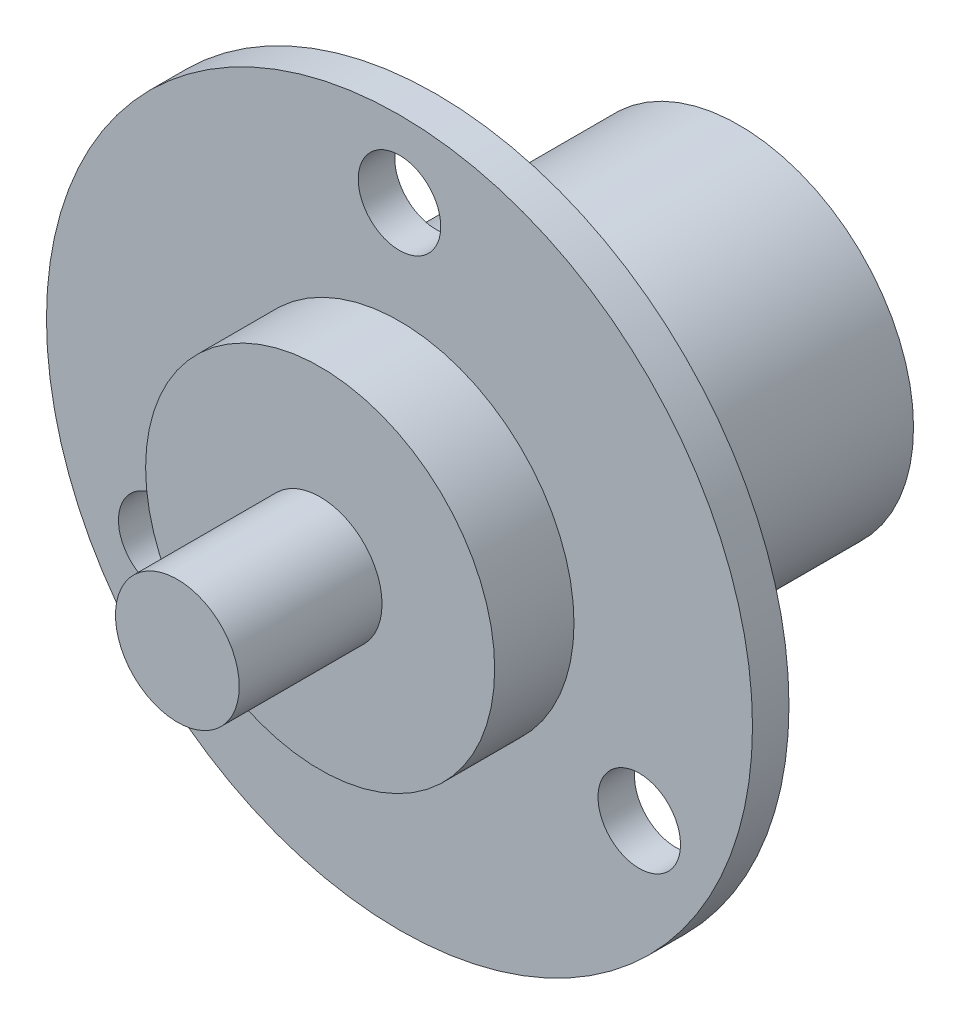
from build123d import *

# Parameters (mm, degrees)
SKETCH_1_R      = 11
EXTRUDE_1_DEPTH = 26.4
SKETCH_2_R      = 22.25
SKETCH_2_R_2    = 2.6
EXTRUDE_2_DEPTH = 2.3
SKETCH_3_R      = 3.9
EXTRUDE_3_DEPTH = 9


with BuildPart() as part:
    # Sketch 1 → Extrude 1 (new body)
    with BuildSketch(Plane.XY):
        Circle(SKETCH_1_R)
    extrude(amount=EXTRUDE_1_DEPTH)

    # Sketch 2 → Extrude 2 (add)
    with BuildSketch(Plane.XY.offset(21.4)):
        Circle(SKETCH_2_R)
        with Locations((0, 17.45)):
            Circle(SKETCH_2_R_2, mode=Mode.SUBTRACT)
        with Locations((15.112143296, -8.725)):
            Circle(SKETCH_2_R_2, mode=Mode.SUBTRACT)
        with Locations((-15.112143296, -8.725)):
            Circle(SKETCH_2_R_2, mode=Mode.SUBTRACT)
    extrude(amount=-EXTRUDE_2_DEPTH)

    # Sketch 3 → Extrude 3 (add)
    with BuildSketch(Plane.XY.offset(26.4)):
        Circle(SKETCH_3_R)
    extrude(amount=EXTRUDE_3_DEPTH)


solid = part.part
